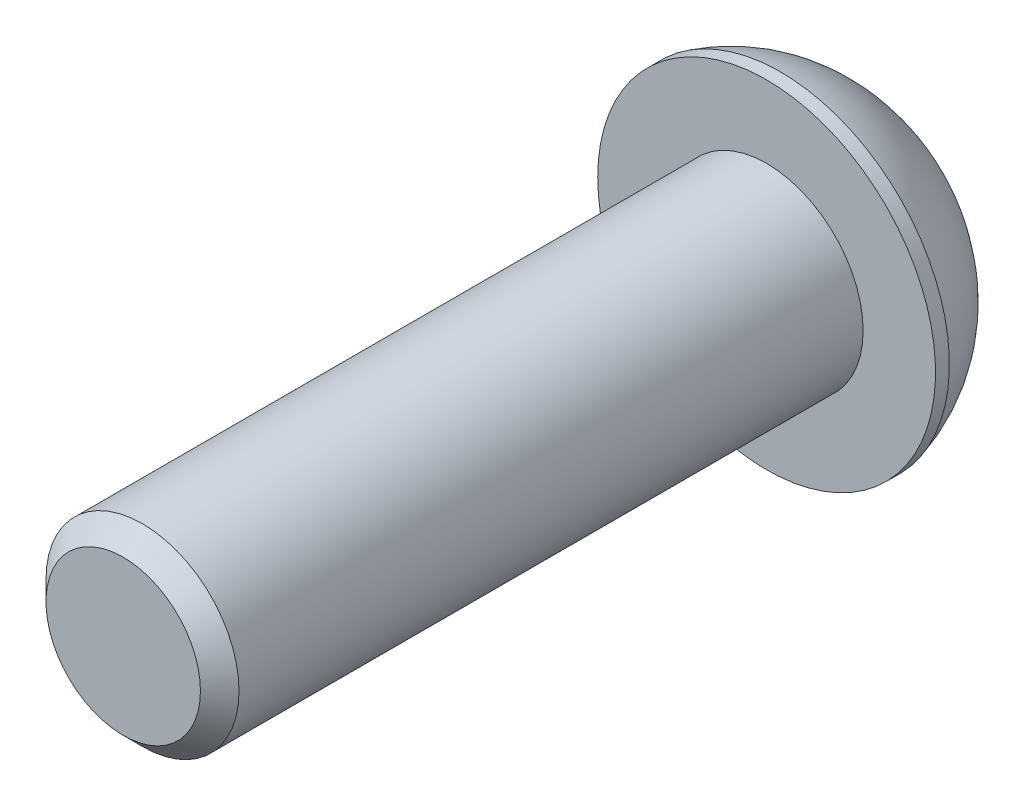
from build123d import *

# Parameters (mm, degrees)
ENLEV_MAT_EXTRU1_DEPTH = 2.08
ESQUISSE3_W            = 3
ESQUISSE3_H            = 20
CHANFREIN1_SIZE        = 0.6


with BuildPart() as part:
    # Esquisse1 → Base-R_volution (revolve)
    with BuildSketch(Plane(origin=(0, 0, 0), x_dir=(1, 0, 0), z_dir=(0, 1, 0)), mode=Mode.PRIVATE) as base_r_volution_sk:
        with BuildLine():
            Line((0, 0), (5.25, 0))
            Line((5.25, 0), (5.25, 0.431200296))
            ThreePointArc((5.25, 0.431200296), (4.434666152, 2.084533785), (3.048692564, 3.3))
            Line((3.048692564, 3.3), (0, 3.3))
            Line((0, 3.3), (0, 0))
        make_face()
    revolve(base_r_volution_sk.sketch.rotate(Axis((0, 0, 0), (0, 0, -1)), 180), axis=Axis((0, 0, 0), (0, 0, -1)))

    # Esquisse2 → enlev-mat-Extru1 (cut)
    with BuildSketch(Plane.XY.offset(-3.3)):
        Polygon((2, -1.154700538), (2, 1.154700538), (0, 2.309401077), (-2, 1.154700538), (-2, -1.154700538), (0, -2.309401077), align=None)
    extrude(amount=ENLEV_MAT_EXTRU1_DEPTH, mode=Mode.SUBTRACT)

    # Esquisse3 → Boss.-R_vol.1 (revolve)
    with BuildSketch(Plane(origin=(0, 0, 0), x_dir=(1, 0, 0), z_dir=(0, 1, 0)), mode=Mode.PRIVATE) as boss_r_vol_1_sk:
        with Locations((1.5, -10)):
            Rectangle(ESQUISSE3_W, ESQUISSE3_H)
    revolve(boss_r_vol_1_sk.sketch.rotate(Axis((0, 0, 0), (0, 0, 1)), 180), axis=Axis((0, 0, 0), (0, 0, 1)))

    # Chanfrein1
    chanfrein1_edges = [part.edges().sort_by_distance(p)[0] for p in [
        (3, 0, 20),
    ]]
    chamfer(chanfrein1_edges, length=CHANFREIN1_SIZE)


solid = part.part
